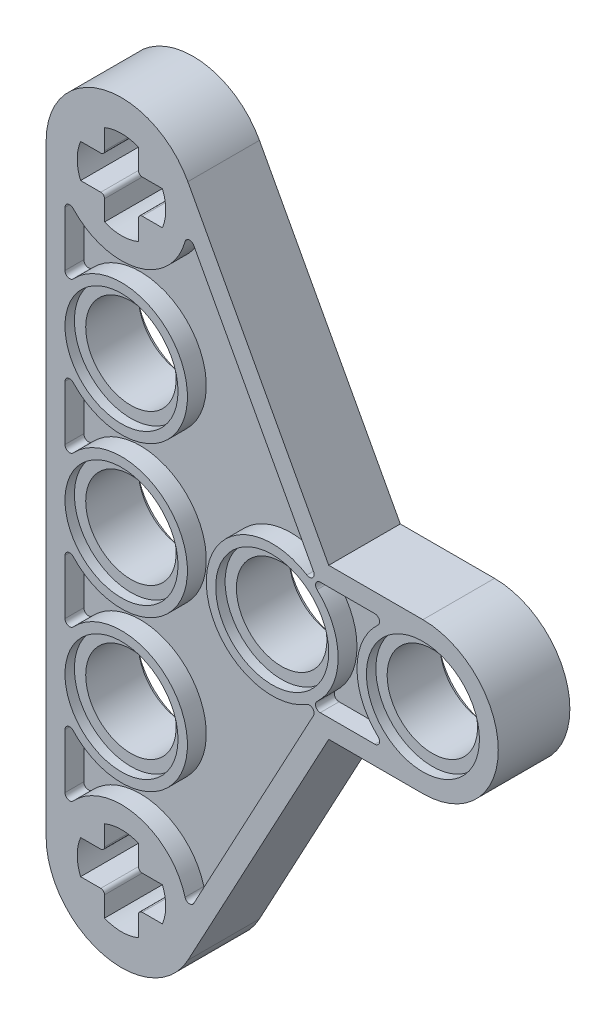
from build123d import *

# Parameters (mm, degrees)
CROQUIS1_R            = 2.4
EXTRUIR1_DEPTH        = 1.9
CROQUIS2_R            = 3
CORTAR_EXTRUIR1_DEPTH = 0.5
CORTAR_EXTRUIR2_DEPTH = 1


with BuildPart() as part:
    # Croquis1 → Extruir1 (new, symmetric)
    with BuildSketch(Plane.XY):
        with BuildLine():
            Line((-5, 4), (0, 4))
            ThreePointArc((0, 4), (4, 0), (0, -4))
            Line((0, -4), (-5, -4))
            Line((-5, -4), (-12.477633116, -17.895502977))
            ThreePointArc((-12.477633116, -17.895502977), (-16.977377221, -19.878754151), (-20, -16))
            Line((-20, -16), (-20, 16))
            ThreePointArc((-20, 16), (-16.977377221, 19.878754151), (-12.477633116, 17.895502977))
            Line((-12.477633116, 17.895502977), (-5, 4))
        make_face()
        with Locations(Location((-16, 8, 0), (0, 0, 180))):
            Circle(CROQUIS1_R, mode=Mode.SUBTRACT)
        with Locations(Location((-16, 0, 0), (0, 0, 180))):
            Circle(CROQUIS1_R, mode=Mode.SUBTRACT)
        with Locations(Location((-8, 0, 0), (0, 0, 180))):
            Circle(CROQUIS1_R, mode=Mode.SUBTRACT)
        with Locations(Location((0, 0, 0), (0, 0, 180))):
            Circle(CROQUIS1_R, mode=Mode.SUBTRACT)
        with Locations(Location((-16, -8, 0), (0, 0, 180))):
            Circle(CROQUIS1_R, mode=Mode.SUBTRACT)
        with BuildLine():
            Line((-18.170829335, 16.9), (-17.1, 16.9))
            ThreePointArc((-17.1, 16.9), (-16.958578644, 16.958578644), (-16.9, 17.1))
            Line((-16.9, 17.1), (-16.9, 18.170829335))
            ThreePointArc((-16.9, 18.170829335), (-16, 18.35), (-15.1, 18.170829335))
            Line((-15.1, 18.170829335), (-15.1, 17.1))
            ThreePointArc((-15.1, 17.1), (-15.041421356, 16.958578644), (-14.9, 16.9))
            Line((-14.9, 16.9), (-13.829170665, 16.9))
            ThreePointArc((-13.829170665, 16.9), (-13.65, 16), (-13.829170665, 15.1))
            Line((-13.829170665, 15.1), (-14.9, 15.1))
            ThreePointArc((-14.9, 15.1), (-15.041421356, 15.041421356), (-15.1, 14.9))
            Line((-15.1, 14.9), (-15.1, 13.829170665))
            ThreePointArc((-15.1, 13.829170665), (-16, 13.65), (-16.9, 13.829170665))
            Line((-16.9, 13.829170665), (-16.9, 14.9))
            ThreePointArc((-16.9, 14.9), (-16.958578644, 15.041421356), (-17.1, 15.1))
            Line((-17.1, 15.1), (-18.170829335, 15.1))
            ThreePointArc((-18.170829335, 15.1), (-18.35, 16), (-18.170829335, 16.9))
        make_face(mode=Mode.SUBTRACT)
        with BuildLine():
            Line((-15.1, -17.1), (-15.1, -18.170829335))
            ThreePointArc((-15.1, -18.170829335), (-16, -18.35), (-16.9, -18.170829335))
            Line((-16.9, -18.170829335), (-16.9, -17.1))
            ThreePointArc((-16.9, -17.1), (-16.958578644, -16.958578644), (-17.1, -16.9))
            Line((-17.1, -16.9), (-18.170829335, -16.9))
            ThreePointArc((-18.170829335, -16.9), (-18.35, -16), (-18.170829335, -15.1))
            Line((-18.170829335, -15.1), (-17.1, -15.1))
            ThreePointArc((-17.1, -15.1), (-16.958578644, -15.041421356), (-16.9, -14.9))
            Line((-16.9, -14.9), (-16.9, -13.829170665))
            ThreePointArc((-16.9, -13.829170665), (-16, -13.65), (-15.1, -13.829170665))
            Line((-15.1, -13.829170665), (-15.1, -14.9))
            ThreePointArc((-15.1, -14.9), (-15.041421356, -15.041421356), (-14.9, -15.1))
            Line((-14.9, -15.1), (-13.829170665, -15.1))
            ThreePointArc((-13.829170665, -15.1), (-13.65, -16), (-13.829170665, -16.9))
            Line((-13.829170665, -16.9), (-14.9, -16.9))
            ThreePointArc((-14.9, -16.9), (-15.041421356, -16.958578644), (-15.1, -17.1))
        make_face(mode=Mode.SUBTRACT)
    extrude(amount=EXTRUIR1_DEPTH, both=True)

    # Croquis2 → Cortar-Extruir1 (cut)
    with BuildSketch(Plane.XY.offset(1.9)):
        with Locations((-16, 0)):
            Circle(CROQUIS2_R)
        with Locations((-8, 0)):
            Circle(CROQUIS2_R)
        Circle(CROQUIS2_R)
        with Locations((-16, 8)):
            Circle(CROQUIS2_R)
        with Locations((-16, -8)):
            Circle(CROQUIS2_R)
    cortar_extruir1 = extrude(amount=-CORTAR_EXTRUIR1_DEPTH, mode=Mode.SUBTRACT)

    # Croquis3 → Cortar-Extruir2 (cut)
    with BuildSketch(Plane.XY.offset(1.9)):
        with BuildLine():
            Line((-12.164121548, 15.123987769), (-5.804469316, 3.306001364))
            ThreePointArc((-5.804469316, 3.306001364), (-5.853323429, 3.005437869), (-6.15630943, 2.975030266))
            ThreePointArc((-6.15630943, 2.975030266), (-11.5, 0), (-6.15630943, -2.975030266))
            ThreePointArc((-6.15630943, -2.975030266), (-5.853323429, -3.005437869), (-5.804469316, -3.306001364))
            Line((-5.804469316, -3.306001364), (-12.164121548, -15.123987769))
            ThreePointArc((-12.164121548, -15.123987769), (-12.412370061, -15.253934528), (-12.625318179, -15.071817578))
            ThreePointArc((-12.625318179, -15.071817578), (-15.169437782, -12.599975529), (-18.566666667, -13.62045756))
            ThreePointArc((-18.566666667, -13.62045756), (-18.841287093, -13.683227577), (-19, -13.450490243))
            Line((-19, -13.450490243), (-19, -10.549509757))
            ThreePointArc((-19, -10.549509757), (-18.841287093, -10.316772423), (-18.566666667, -10.37954244))
            ThreePointArc((-18.566666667, -10.37954244), (-13.725848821, -10.66049552), (-13.25, -5.834936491))
            ThreePointArc((-13.25, -5.834936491), (-15.858921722, -4.502844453), (-18.566666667, -5.62045756))
            ThreePointArc((-18.566666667, -5.62045756), (-18.841287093, -5.683227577), (-19, -5.450490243))
            Line((-19, -5.450490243), (-19, -2.549509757))
            ThreePointArc((-19, -2.549509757), (-18.841287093, -2.316772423), (-18.566666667, -2.37954244))
            ThreePointArc((-18.566666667, -2.37954244), (-12.5, 0), (-18.566666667, 2.37954244))
            ThreePointArc((-18.566666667, 2.37954244), (-18.841287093, 2.316772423), (-19, 2.549509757))
            Line((-19, 2.549509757), (-19, 5.450490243))
            ThreePointArc((-19, 5.450490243), (-18.841287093, 5.683227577), (-18.566666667, 5.62045756))
            ThreePointArc((-18.566666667, 5.62045756), (-15.858921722, 4.502844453), (-13.25, 5.834936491))
            ThreePointArc((-13.25, 5.834936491), (-13.725848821, 10.66049552), (-18.566666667, 10.37954244))
            ThreePointArc((-18.566666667, 10.37954244), (-18.841287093, 10.316772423), (-19, 10.549509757))
            Line((-19, 10.549509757), (-19, 13.450490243))
            ThreePointArc((-19, 13.450490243), (-18.841287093, 13.683227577), (-18.566666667, 13.62045756))
            ThreePointArc((-18.566666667, 13.62045756), (-15.169437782, 12.599975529), (-12.625318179, 15.071817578))
            ThreePointArc((-12.625318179, 15.071817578), (-12.412370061, 15.253934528), (-12.164121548, 15.123987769))
        make_face()
        with BuildLine():
            Line((-5.450490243, 3), (-2.549509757, 3))
            ThreePointArc((-2.549509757, 3), (-2.316772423, 2.841287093), (-2.37954244, 2.566666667))
            ThreePointArc((-2.37954244, 2.566666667), (-3.5, 0), (-2.37954244, -2.566666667))
            ThreePointArc((-2.37954244, -2.566666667), (-2.316772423, -2.841287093), (-2.549509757, -3))
            Line((-2.549509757, -3), (-5.450490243, -3))
            ThreePointArc((-5.450490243, -3), (-5.683227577, -2.841287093), (-5.62045756, -2.566666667))
            ThreePointArc((-5.62045756, -2.566666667), (-4.5, 0), (-5.62045756, 2.566666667))
            ThreePointArc((-5.62045756, 2.566666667), (-5.683227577, 2.841287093), (-5.450490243, 3))
        make_face()
    cortar_extruir2 = extrude(amount=-CORTAR_EXTRUIR2_DEPTH, mode=Mode.SUBTRACT)

    # Simetr_a1: Cortar-Extruir2 across plane
    add(cortar_extruir2.mirror(Plane.XY), mode=Mode.SUBTRACT)

    # Simetr_a2: Cortar-Extruir1 across plane
    add(cortar_extruir1.mirror(Plane.XY), mode=Mode.SUBTRACT)


solid = part.part
